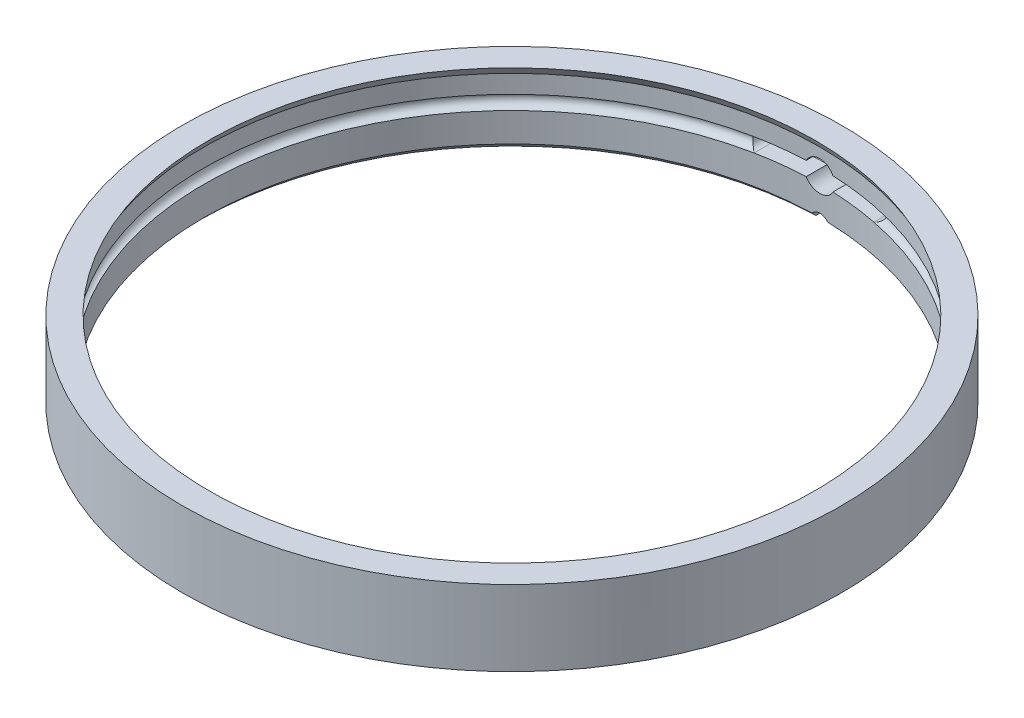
ISO-10303-21;
HEADER;
FILE_DESCRIPTION(('STEP AP214'),'2;1');
FILE_NAME('part.step','',(''),(''),'','','');
FILE_SCHEMA(('AUTOMOTIVE_DESIGN { 1 0 10303 214 1 1 1 1 }'));
ENDSEC;
DATA;
#1=APPLICATION_CONTEXT('core data for automotive mechanical design processes');
#2=APPLICATION_PROTOCOL_DEFINITION('international standard','automotive_design',2000,#1);
#3=PRODUCT_CONTEXT('',#1,'mechanical');
#4=PRODUCT('Part','Part','',(#3));
#5=PRODUCT_RELATED_PRODUCT_CATEGORY('part','',(#4));
#6=PRODUCT_DEFINITION_FORMATION('','',#4);
#7=PRODUCT_DEFINITION_CONTEXT('part definition',#1,'design');
#8=PRODUCT_DEFINITION('design','',#6,#7);
#9=PRODUCT_DEFINITION_SHAPE('','',#8);
#10=(LENGTH_UNIT() NAMED_UNIT(*) SI_UNIT(.MILLI.,.METRE.));
#11=(NAMED_UNIT(*) PLANE_ANGLE_UNIT() SI_UNIT($,.RADIAN.));
#12=(NAMED_UNIT(*) SI_UNIT($,.STERADIAN.) SOLID_ANGLE_UNIT());
#13=UNCERTAINTY_MEASURE_WITH_UNIT(LENGTH_MEASURE(1.E-05),#10,'distance_accuracy_value','');
#14=(GEOMETRIC_REPRESENTATION_CONTEXT(3) GLOBAL_UNCERTAINTY_ASSIGNED_CONTEXT((#13)) GLOBAL_UNIT_ASSIGNED_CONTEXT((#10,
#11,#12)) REPRESENTATION_CONTEXT('',''));
#15=CARTESIAN_POINT('',(0.,0.,0.));
#16=DIRECTION('',(0.,0.,1.));
#17=DIRECTION('',(1.,0.,0.));
#18=AXIS2_PLACEMENT_3D('',#15,#16,#17);
#19=CARTESIAN_POINT('',(0.,19.05,0.));
#20=DIRECTION('',(0.,-1.,0.));
#21=DIRECTION('',(0.,0.,-1.));
#22=AXIS2_PLACEMENT_3D('',#19,#20,#21);
#23=CYLINDRICAL_SURFACE('',#22,83.185);
#24=CARTESIAN_POINT('',(3.36969078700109,12.446,-83.1167215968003));
#25=CARTESIAN_POINT('',(3.31968015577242,12.5408027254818,-83.1187485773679));
#26=CARTESIAN_POINT('',(3.26565454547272,12.633478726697,-83.1208941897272));
#27=CARTESIAN_POINT('',(3.1499972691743,12.813945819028,-83.1253578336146));
#28=CARTESIAN_POINT('',(3.08836598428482,12.9017371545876,-83.1276758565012));
#29=CARTESIAN_POINT('',(2.95796146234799,13.0717540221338,-83.1324180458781));
#30=CARTESIAN_POINT('',(2.8891932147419,13.1539833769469,-83.1348421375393));
#31=CARTESIAN_POINT('',(2.74500289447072,13.3123415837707,-83.1397281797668));
#32=CARTESIAN_POINT('',(2.66958089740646,13.3884705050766,-83.1421901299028));
#33=CARTESIAN_POINT('',(2.43402091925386,13.6069474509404,-83.1495301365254));
#34=CARTESIAN_POINT('',(2.26453287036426,13.7394586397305,-83.1543644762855));
#35=CARTESIAN_POINT('',(1.90582206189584,13.9740439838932,-83.1633586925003));
#36=CARTESIAN_POINT('',(1.71660316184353,14.0761240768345,-83.1675187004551));
#37=CARTESIAN_POINT('',(1.3236903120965,14.2470796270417,-83.1746993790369));
#38=CARTESIAN_POINT('',(1.11999798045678,14.3159587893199,-83.1777201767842));
#39=CARTESIAN_POINT('',(0.703899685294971,14.4185408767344,-83.1822819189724));
#40=CARTESIAN_POINT('',(0.491492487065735,14.4522387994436,-83.1838226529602));
#41=CARTESIAN_POINT('',(0.0642344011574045,14.4834695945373,-83.1852491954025));
#42=CARTESIAN_POINT('',(-0.150613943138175,14.481037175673,-83.185136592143));
#43=CARTESIAN_POINT('',(-0.576830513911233,14.4401605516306,-83.1832730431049));
#44=CARTESIAN_POINT('',(-0.788199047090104,14.4017195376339,-83.181522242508));
#45=CARTESIAN_POINT('',(-1.20139535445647,14.2899527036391,-83.1765806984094));
#46=CARTESIAN_POINT('',(-1.40322672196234,14.2166401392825,-83.1733905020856));
#47=CARTESIAN_POINT('',(-1.79177138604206,14.0371909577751,-83.1659280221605));
#48=CARTESIAN_POINT('',(-1.97848113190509,13.9310466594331,-83.1616554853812));
#49=CARTESIAN_POINT('',(-2.33164911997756,13.6888356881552,-83.1525040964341));
#50=CARTESIAN_POINT('',(-2.49808184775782,13.5527319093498,-83.1476244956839));
#51=CARTESIAN_POINT('',(-2.80561856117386,13.2545716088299,-83.1378158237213));
#52=CARTESIAN_POINT('',(-2.94675090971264,13.0925445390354,-83.1328868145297));
#53=CARTESIAN_POINT('',(-3.12838575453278,12.8447090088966,-83.1261721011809));
#54=CARTESIAN_POINT('',(-3.18078538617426,12.7673887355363,-83.1241800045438));
#55=CARTESIAN_POINT('',(-3.27968022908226,12.6092528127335,-83.1203365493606));
#56=CARTESIAN_POINT('',(-3.32618602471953,12.5284437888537,-83.1184849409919));
#57=CARTESIAN_POINT('',(-3.36969078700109,12.446,-83.1167215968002));
#58=B_SPLINE_CURVE_WITH_KNOTS('',3,(#24,#25,#26,#27,#28,#29,#30,#31,#32,#33,#34,#35,#36,#37,#38,
#39,#40,#41,#42,#43,#44,#45,#46,#47,#48,#49,#50,#51,#52,#53,#54,#55,#56,#57),.UNSPECIFIED.,.F.,
.F.,(4,2,2,2,2,2,2,2,2,2,2,2,2,2,2,2,4),(0.,0.321507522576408,0.642998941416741,
0.964267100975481,1.28553161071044,1.92778791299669,2.56991881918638,3.21197805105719,
3.85412856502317,4.49566223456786,5.13713905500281,5.77837222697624,6.41975553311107,
7.061937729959,7.70339544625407,7.98346076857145,8.26301578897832),.UNSPECIFIED.);
#59=CARTESIAN_POINT('',(3.36969078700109,12.446,-83.1167215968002));
#60=VERTEX_POINT('',#59);
#61=CARTESIAN_POINT('',(-3.36969078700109,12.446,-83.1167215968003));
#62=VERTEX_POINT('',#61);
#63=EDGE_CURVE('E245',#60,#62,#58,.T.);
#64=ORIENTED_EDGE('',*,*,#63,.T.);
#65=CARTESIAN_POINT('',(0.,12.446,0.));
#66=DIRECTION('',(0.,1.,0.));
#67=DIRECTION('',(-1.,0.,0.));
#68=AXIS2_PLACEMENT_3D('',#65,#66,#67);
#69=CIRCLE('',#68,83.185);
#70=CARTESIAN_POINT('',(-15.113,12.446,-81.8006201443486));
#71=VERTEX_POINT('',#70);
#72=EDGE_CURVE('E128',#62,#71,#69,.T.);
#73=ORIENTED_EDGE('',*,*,#72,.T.);
#74=CARTESIAN_POINT('',(-15.113,12.446,-81.8006201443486));
#75=CARTESIAN_POINT('',(-15.163770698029,12.4459992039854,-81.7912403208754));
#76=CARTESIAN_POINT('',(-15.2145080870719,12.4438240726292,-81.7818171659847));
#77=CARTESIAN_POINT('',(-15.3156049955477,12.4351480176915,-81.762944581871));
#78=CARTESIAN_POINT('',(-15.3659645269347,12.4286472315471,-81.7534951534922));
#79=CARTESIAN_POINT('',(-15.5158968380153,12.4027108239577,-81.7252192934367));
#80=CARTESIAN_POINT('',(-15.6144440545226,12.3768410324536,-81.7064429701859));
#81=CARTESIAN_POINT('',(-15.805814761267,12.3086189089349,-81.6696392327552));
#82=CARTESIAN_POINT('',(-15.8986351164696,12.2662576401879,-81.6516122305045));
#83=CARTESIAN_POINT('',(-16.0758570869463,12.1661775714,-81.6169050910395));
#84=CARTESIAN_POINT('',(-16.1602611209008,12.108463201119,-81.6002245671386));
#85=CARTESIAN_POINT('',(-16.3176670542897,11.9796188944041,-81.5688934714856));
#86=CARTESIAN_POINT('',(-16.3907357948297,11.9085735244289,-81.5542310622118));
#87=CARTESIAN_POINT('',(-16.5238707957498,11.7547705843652,-81.527360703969));
#88=CARTESIAN_POINT('',(-16.5839361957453,11.6720122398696,-81.5151529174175));
#89=CARTESIAN_POINT('',(-16.6882116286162,11.4986873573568,-81.4938685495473));
#90=CARTESIAN_POINT('',(-16.7326818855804,11.4082837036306,-81.48474068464));
#91=CARTESIAN_POINT('',(-16.8057861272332,11.2210421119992,-81.4696948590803));
#92=CARTESIAN_POINT('',(-16.8344229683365,11.1242053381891,-81.4637763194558));
#93=CARTESIAN_POINT('',(-16.8745432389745,10.9287924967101,-81.455475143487));
#94=CARTESIAN_POINT('',(-16.8863378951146,10.8302829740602,-81.4530283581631));
#95=CARTESIAN_POINT('',(-16.8933959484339,10.6326491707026,-81.4515648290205));
#96=CARTESIAN_POINT('',(-16.888660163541,10.5335249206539,-81.4525479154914));
#97=CARTESIAN_POINT('',(-16.8629353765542,10.3384568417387,-81.4578774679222));
#98=CARTESIAN_POINT('',(-16.8420995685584,10.2424918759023,-81.4621922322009));
#99=CARTESIAN_POINT('',(-16.7850191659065,10.0554679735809,-81.4739725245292));
#100=CARTESIAN_POINT('',(-16.748774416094,9.9644090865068,-81.4814380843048));
#101=CARTESIAN_POINT('',(-16.6617604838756,9.78922757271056,-81.4992756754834));
#102=CARTESIAN_POINT('',(-16.6109155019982,9.70514417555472,-81.5096628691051));
#103=CARTESIAN_POINT('',(-16.4963053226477,9.54670070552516,-81.5329353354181));
#104=CARTESIAN_POINT('',(-16.4325397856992,9.47234088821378,-81.5458206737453));
#105=CARTESIAN_POINT('',(-16.2927739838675,9.33411976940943,-81.5738615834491));
#106=CARTESIAN_POINT('',(-16.2165889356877,9.27045228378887,-81.5890511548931));
#107=CARTESIAN_POINT('',(-16.0549026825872,9.15675070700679,-81.6210212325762));
#108=CARTESIAN_POINT('',(-15.9693975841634,9.10672234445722,-81.6378024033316));
#109=CARTESIAN_POINT('',(-15.7897309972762,9.02074891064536,-81.6727442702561));
#110=CARTESIAN_POINT('',(-15.6954330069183,8.98509813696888,-81.6909255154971));
#111=CARTESIAN_POINT('',(-15.5023437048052,8.9302606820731,-81.7277870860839));
#112=CARTESIAN_POINT('',(-15.403559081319,8.9110502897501,-81.7464666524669));
#113=CARTESIAN_POINT('',(-15.2722486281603,8.89685670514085,-81.7710444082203));
#114=CARTESIAN_POINT('',(-15.2404280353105,8.89428424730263,-81.7769810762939));
#115=CARTESIAN_POINT('',(-15.1767436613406,8.89085819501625,-81.7888239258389));
#116=CARTESIAN_POINT('',(-15.1448800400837,8.89000174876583,-81.7947301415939));
#117=CARTESIAN_POINT('',(-15.113,8.89,-81.8006201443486));
#118=B_SPLINE_CURVE_WITH_KNOTS('',3,(#74,#75,#76,#77,#78,#79,#80,#81,#82,#83,#84,#85,#86,#87,
#88,#89,#90,#91,#92,#93,#94,#95,#96,#97,#98,#99,#100,#101,#102,#103,#104,#105,#106,#107,#108,
#109,#110,#111,#112,#113,#114,#115,#116,#117),.UNSPECIFIED.,.F.,.F.,(4,2,2,2,2,2,2,2,2,2,2,2,2,
2,2,2,2,2,2,2,2,4),(0.,0.15479448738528,0.309584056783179,0.618799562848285,0.928182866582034,
1.23747700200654,1.54487165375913,1.8522866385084,2.15429614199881,2.4562511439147,
2.75255072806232,3.04883565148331,3.3423355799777,3.63583846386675,3.93089355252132,
4.22595639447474,4.52589565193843,4.82596069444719,5.13188916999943,5.43737567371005,
5.53475869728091,5.63197974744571),.UNSPECIFIED.);
#119=CARTESIAN_POINT('',(-15.113,8.89,-81.8006201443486));
#120=VERTEX_POINT('',#119);
#121=EDGE_CURVE('E127',#71,#120,#118,.T.);
#122=ORIENTED_EDGE('',*,*,#121,.T.);
#123=CARTESIAN_POINT('',(0.,8.89,0.));
#124=DIRECTION('',(0.,1.,0.));
#125=DIRECTION('',(-1.,0.,0.));
#126=AXIS2_PLACEMENT_3D('',#123,#124,#125);
#127=CIRCLE('',#126,83.185);
#128=CARTESIAN_POINT('',(-3.36969078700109,8.89,-83.1167215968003));
#129=VERTEX_POINT('',#128);
#130=EDGE_CURVE('E137',#129,#120,#127,.T.);
#131=ORIENTED_EDGE('',*,*,#130,.F.);
#132=CARTESIAN_POINT('',(-3.36969078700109,8.89,-83.1167215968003));
#133=CARTESIAN_POINT('',(-3.31968015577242,8.79519727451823,-83.1187485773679));
#134=CARTESIAN_POINT('',(-3.26565454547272,8.70252127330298,-83.1208941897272));
#135=CARTESIAN_POINT('',(-3.1499972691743,8.52205418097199,-83.1253578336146));
#136=CARTESIAN_POINT('',(-3.08836598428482,8.43426284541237,-83.1276758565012));
#137=CARTESIAN_POINT('',(-2.95796146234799,8.26424597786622,-83.1324180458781));
#138=CARTESIAN_POINT('',(-2.8891932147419,8.18201662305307,-83.1348421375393));
#139=CARTESIAN_POINT('',(-2.74500289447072,8.02365841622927,-83.1397281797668));
#140=CARTESIAN_POINT('',(-2.66958089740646,7.94752949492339,-83.1421901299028));
#141=CARTESIAN_POINT('',(-2.43402091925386,7.72905254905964,-83.1495301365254));
#142=CARTESIAN_POINT('',(-2.26453287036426,7.5965413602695,-83.1543644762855));
#143=CARTESIAN_POINT('',(-1.90582206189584,7.36195601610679,-83.1633586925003));
#144=CARTESIAN_POINT('',(-1.71660316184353,7.25987592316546,-83.1675187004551));
#145=CARTESIAN_POINT('',(-1.3236903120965,7.08892037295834,-83.1746993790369));
#146=CARTESIAN_POINT('',(-1.11999798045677,7.02004121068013,-83.1777201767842));
#147=CARTESIAN_POINT('',(-0.70389968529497,6.91745912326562,-83.1822819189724));
#148=CARTESIAN_POINT('',(-0.491492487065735,6.88376120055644,-83.1838226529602));
#149=CARTESIAN_POINT('',(-0.0642344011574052,6.85253040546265,-83.1852491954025));
#150=CARTESIAN_POINT('',(0.150613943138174,6.854962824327,-83.185136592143));
#151=CARTESIAN_POINT('',(0.576830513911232,6.89583944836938,-83.1832730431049));
#152=CARTESIAN_POINT('',(0.788199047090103,6.93428046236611,-83.181522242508));
#153=CARTESIAN_POINT('',(1.20139535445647,7.04604729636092,-83.1765806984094));
#154=CARTESIAN_POINT('',(1.40322672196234,7.11935986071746,-83.1733905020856));
#155=CARTESIAN_POINT('',(1.79177138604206,7.29880904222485,-83.1659280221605));
#156=CARTESIAN_POINT('',(1.97848113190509,7.4049533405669,-83.1616554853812));
#157=CARTESIAN_POINT('',(2.33164911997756,7.64716431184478,-83.1525040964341));
#158=CARTESIAN_POINT('',(2.49808184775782,7.78326809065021,-83.1476244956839));
#159=CARTESIAN_POINT('',(2.80561856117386,8.08142839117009,-83.1378158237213));
#160=CARTESIAN_POINT('',(2.94675090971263,8.24345546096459,-83.1328868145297));
#161=CARTESIAN_POINT('',(3.12838575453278,8.49129099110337,-83.1261721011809));
#162=CARTESIAN_POINT('',(3.18078538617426,8.56861126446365,-83.1241800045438));
#163=CARTESIAN_POINT('',(3.27968022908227,8.72674718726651,-83.1203365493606));
#164=CARTESIAN_POINT('',(3.32618602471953,8.80755621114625,-83.1184849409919));
#165=CARTESIAN_POINT('',(3.36969078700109,8.89,-83.1167215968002));
#166=B_SPLINE_CURVE_WITH_KNOTS('',3,(#132,#133,#134,#135,#136,#137,#138,#139,#140,#141,#142,
#143,#144,#145,#146,#147,#148,#149,#150,#151,#152,#153,#154,#155,#156,#157,#158,#159,#160,#161,
#162,#163,#164,#165),.UNSPECIFIED.,.F.,.F.,(4,2,2,2,2,2,2,2,2,2,2,2,2,2,2,2,4),(0.,
0.321507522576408,0.642998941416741,0.964267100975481,1.28553161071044,1.92778791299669,
2.56991881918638,3.21197805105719,3.85412856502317,4.49566223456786,5.13713905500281,
5.77837222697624,6.41975553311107,7.061937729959,7.70339544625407,7.98346076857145,
8.26301578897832),.UNSPECIFIED.);
#167=CARTESIAN_POINT('',(3.36969078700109,8.89,-83.1167215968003));
#168=VERTEX_POINT('',#167);
#169=EDGE_CURVE('E256',#129,#168,#166,.T.);
#170=ORIENTED_EDGE('',*,*,#169,.T.);
#171=CARTESIAN_POINT('',(0.,8.89,0.));
#172=DIRECTION('',(0.,1.,0.));
#173=DIRECTION('',(-1.,0.,0.));
#174=AXIS2_PLACEMENT_3D('',#171,#172,#173);
#175=CIRCLE('',#174,83.185);
#176=CARTESIAN_POINT('',(15.113,8.89,-81.8006201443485));
#177=VERTEX_POINT('',#176);
#178=EDGE_CURVE('E347',#177,#168,#175,.T.);
#179=ORIENTED_EDGE('',*,*,#178,.F.);
#180=CARTESIAN_POINT('',(15.113,8.89,-81.8006201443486));
#181=CARTESIAN_POINT('',(15.163770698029,8.89000079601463,-81.7912403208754));
#182=CARTESIAN_POINT('',(15.2145080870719,8.89217592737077,-81.7818171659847));
#183=CARTESIAN_POINT('',(15.3156049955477,8.90085198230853,-81.762944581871));
#184=CARTESIAN_POINT('',(15.3659645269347,8.90735276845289,-81.7534951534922));
#185=CARTESIAN_POINT('',(15.5158968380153,8.93328917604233,-81.7252192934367));
#186=CARTESIAN_POINT('',(15.6144440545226,8.95915896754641,-81.7064429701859));
#187=CARTESIAN_POINT('',(15.805814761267,9.02738109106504,-81.6696392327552));
#188=CARTESIAN_POINT('',(15.8986351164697,9.06974235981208,-81.6516122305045));
#189=CARTESIAN_POINT('',(16.0758570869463,9.16982242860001,-81.6169050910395));
#190=CARTESIAN_POINT('',(16.1602611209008,9.22753679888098,-81.6002245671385));
#191=CARTESIAN_POINT('',(16.3176670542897,9.35638110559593,-81.5688934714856));
#192=CARTESIAN_POINT('',(16.3907357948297,9.42742647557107,-81.5542310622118));
#193=CARTESIAN_POINT('',(16.5238707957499,9.58122941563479,-81.527360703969));
#194=CARTESIAN_POINT('',(16.5839361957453,9.66398776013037,-81.5151529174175));
#195=CARTESIAN_POINT('',(16.6882116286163,9.83731264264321,-81.4938685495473));
#196=CARTESIAN_POINT('',(16.7326818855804,9.92771629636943,-81.48474068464));
#197=CARTESIAN_POINT('',(16.8057861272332,10.1149578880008,-81.4696948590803));
#198=CARTESIAN_POINT('',(16.8344229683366,10.2117946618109,-81.4637763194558));
#199=CARTESIAN_POINT('',(16.8745432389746,10.4072075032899,-81.455475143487));
#200=CARTESIAN_POINT('',(16.8863378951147,10.5057170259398,-81.4530283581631));
#201=CARTESIAN_POINT('',(16.8933959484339,10.7033508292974,-81.4515648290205));
#202=CARTESIAN_POINT('',(16.8886601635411,10.8024750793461,-81.4525479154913));
#203=CARTESIAN_POINT('',(16.8629353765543,10.9975431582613,-81.4578774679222));
#204=CARTESIAN_POINT('',(16.8420995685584,11.0935081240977,-81.4621922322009));
#205=CARTESIAN_POINT('',(16.7850191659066,11.2805320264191,-81.4739725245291));
#206=CARTESIAN_POINT('',(16.7487744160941,11.3715909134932,-81.4814380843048));
#207=CARTESIAN_POINT('',(16.6617604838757,11.5467724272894,-81.4992756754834));
#208=CARTESIAN_POINT('',(16.6109155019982,11.6308558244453,-81.5096628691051));
#209=CARTESIAN_POINT('',(16.4963053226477,11.7892992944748,-81.5329353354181));
#210=CARTESIAN_POINT('',(16.4325397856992,11.8636591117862,-81.5458206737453));
#211=CARTESIAN_POINT('',(16.2927739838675,12.0018802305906,-81.5738615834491));
#212=CARTESIAN_POINT('',(16.2165889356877,12.0655477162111,-81.5890511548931));
#213=CARTESIAN_POINT('',(16.0549026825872,12.1792492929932,-81.6210212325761));
#214=CARTESIAN_POINT('',(15.9693975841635,12.2292776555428,-81.6378024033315));
#215=CARTESIAN_POINT('',(15.7897309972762,12.3152510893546,-81.6727442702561));
#216=CARTESIAN_POINT('',(15.6954330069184,12.3509018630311,-81.6909255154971));
#217=CARTESIAN_POINT('',(15.5023437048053,12.4057393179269,-81.7277870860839));
#218=CARTESIAN_POINT('',(15.4035590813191,12.4249497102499,-81.7464666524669));
#219=CARTESIAN_POINT('',(15.2722486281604,12.4391432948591,-81.7710444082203));
#220=CARTESIAN_POINT('',(15.2404280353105,12.4417157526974,-81.7769810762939));
#221=CARTESIAN_POINT('',(15.1767436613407,12.4451418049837,-81.7888239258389));
#222=CARTESIAN_POINT('',(15.1448800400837,12.4459982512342,-81.7947301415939));
#223=CARTESIAN_POINT('',(15.113,12.446,-81.8006201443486));
#224=B_SPLINE_CURVE_WITH_KNOTS('',3,(#180,#181,#182,#183,#184,#185,#186,#187,#188,#189,#190,
#191,#192,#193,#194,#195,#196,#197,#198,#199,#200,#201,#202,#203,#204,#205,#206,#207,#208,#209,
#210,#211,#212,#213,#214,#215,#216,#217,#218,#219,#220,#221,#222,#223),.UNSPECIFIED.,.F.,.F.,(4,
2,2,2,2,2,2,2,2,2,2,2,2,2,2,2,2,2,2,2,2,4),(0.,0.154794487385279,0.309584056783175,
0.618799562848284,0.928182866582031,1.23747700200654,1.54487165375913,1.8522866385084,
2.15429614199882,2.4562511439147,2.75255072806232,3.04883565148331,3.34233557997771,
3.63583846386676,3.93089355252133,4.22595639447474,4.52589565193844,4.82596069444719,
5.13188916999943,5.43737567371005,5.53475869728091,5.63197974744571),.UNSPECIFIED.);
#225=CARTESIAN_POINT('',(15.113,12.446,-81.8006201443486));
#226=VERTEX_POINT('',#225);
#227=EDGE_CURVE('E238',#177,#226,#224,.T.);
#228=ORIENTED_EDGE('',*,*,#227,.T.);
#229=CARTESIAN_POINT('',(0.,12.446,0.));
#230=DIRECTION('',(0.,1.,0.));
#231=DIRECTION('',(-1.,0.,0.));
#232=AXIS2_PLACEMENT_3D('',#229,#230,#231);
#233=CIRCLE('',#232,83.185);
#234=EDGE_CURVE('E456',#226,#60,#233,.T.);
#235=ORIENTED_EDGE('',*,*,#234,.T.);
#236=EDGE_LOOP('',(#64,#73,#122,#131,#170,#179,#228,#235));
#237=FACE_BOUND('',#236,.T.);
#238=CARTESIAN_POINT('',(0.,19.05,0.));
#239=DIRECTION('',(0.,1.,0.));
#240=DIRECTION('',(0.,0.,1.));
#241=AXIS2_PLACEMENT_3D('',#238,#239,#240);
#242=CIRCLE('',#241,83.185);
#243=CARTESIAN_POINT('',(0.,19.05,83.185));
#244=VERTEX_POINT('',#243);
#245=EDGE_CURVE('E164',#244,#244,#242,.T.);
#246=ORIENTED_EDGE('',*,*,#245,.F.);
#247=EDGE_LOOP('',(#246));
#248=FACE_BOUND('',#247,.T.);
#249=CARTESIAN_POINT('',(0.,0.,0.));
#250=DIRECTION('',(0.,1.,0.));
#251=DIRECTION('',(0.,0.,1.));
#252=AXIS2_PLACEMENT_3D('',#249,#250,#251);
#253=CIRCLE('',#252,83.185);
#254=CARTESIAN_POINT('',(-2.54,0.,-83.1462123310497));
#255=VERTEX_POINT('',#254);
#256=CARTESIAN_POINT('',(2.54,0.,-83.1462123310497));
#257=VERTEX_POINT('',#256);
#258=EDGE_CURVE('E158',#255,#257,#253,.T.);
#259=ORIENTED_EDGE('',*,*,#258,.T.);
#260=CARTESIAN_POINT('',(2.54,0.,-83.1462123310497));
#261=CARTESIAN_POINT('',(2.5400068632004,0.0714220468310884,-83.1462114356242));
#262=CARTESIAN_POINT('',(2.53698755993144,0.142840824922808,-83.146304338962));
#263=CARTESIAN_POINT('',(2.52494973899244,0.285167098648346,-83.1466711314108));
#264=CARTESIAN_POINT('',(2.51593151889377,0.356074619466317,-83.1469450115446));
#265=CARTESIAN_POINT('',(2.49195762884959,0.496829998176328,-83.1476668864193));
#266=CARTESIAN_POINT('',(2.47700624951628,0.566678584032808,-83.1481147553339));
#267=CARTESIAN_POINT('',(2.44128759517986,0.704850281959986,-83.1491711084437));
#268=CARTESIAN_POINT('',(2.4205203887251,0.773173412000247,-83.1497795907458));
#269=CARTESIAN_POINT('',(2.34966439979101,0.975192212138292,-83.1518224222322));
#270=CARTESIAN_POINT('',(2.29101083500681,1.10599809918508,-83.15347448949));
#271=CARTESIAN_POINT('',(2.1526259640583,1.3558085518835,-83.1571715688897));
#272=CARTESIAN_POINT('',(2.07289864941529,1.47481534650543,-83.159216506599));
#273=CARTESIAN_POINT('',(1.89457075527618,1.69781550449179,-83.1634701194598));
#274=CARTESIAN_POINT('',(1.79596428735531,1.8018041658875,-83.1656788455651));
#275=CARTESIAN_POINT('',(1.58268002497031,1.9917644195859,-83.1700108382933));
#276=CARTESIAN_POINT('',(1.46799978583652,2.07773326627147,-83.1721340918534));
#277=CARTESIAN_POINT('',(1.22581097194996,2.22921270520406,-83.1760558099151));
#278=CARTESIAN_POINT('',(1.09830045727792,2.29472019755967,-83.1778542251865));
#279=CARTESIAN_POINT('',(0.834093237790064,2.4033916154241,-83.1809229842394));
#280=CARTESIAN_POINT('',(0.697397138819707,2.44655701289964,-83.1821933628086));
#281=CARTESIAN_POINT('',(0.418734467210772,2.50931326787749,-83.1840626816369));
#282=CARTESIAN_POINT('',(0.276769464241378,2.52891108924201,-83.1846618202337));
#283=CARTESIAN_POINT('',(-0.00844012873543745,2.54399728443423,-83.1851217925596));
#284=CARTESIAN_POINT('',(-0.151684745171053,2.53948515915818,-83.1849826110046));
#285=CARTESIAN_POINT('',(-0.43533220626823,2.50648462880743,-83.1839817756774));
#286=CARTESIAN_POINT('',(-0.575736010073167,2.47800445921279,-83.1831203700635));
#287=CARTESIAN_POINT('',(-0.849768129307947,2.39788909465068,-83.1807724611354));
#288=CARTESIAN_POINT('',(-0.98339645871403,2.34625394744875,-83.1792859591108));
#289=CARTESIAN_POINT('',(-1.24011415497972,2.22128374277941,-83.1758549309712));
#290=CARTESIAN_POINT('',(-1.36320145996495,2.14794445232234,-83.1739103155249));
#291=CARTESIAN_POINT('',(-1.59531380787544,1.9816544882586,-83.1697823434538));
#292=CARTESIAN_POINT('',(-1.70433949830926,1.88870471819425,-83.1675989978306));
#293=CARTESIAN_POINT('',(-1.90527390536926,1.68580099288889,-83.1632387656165));
#294=CARTESIAN_POINT('',(-1.99717791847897,1.57584238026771,-83.1610618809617));
#295=CARTESIAN_POINT('',(-2.16125155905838,1.34201030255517,-83.1569598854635));
#296=CARTESIAN_POINT('',(-2.23341493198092,1.218132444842,-83.1550348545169));
#297=CARTESIAN_POINT('',(-2.35595471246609,0.959959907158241,-83.1516534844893));
#298=CARTESIAN_POINT('',(-2.40631765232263,0.825658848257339,-83.1501974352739));
#299=CARTESIAN_POINT('',(-2.48370217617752,0.550606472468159,-83.1479222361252));
#300=CARTESIAN_POINT('',(-2.51075937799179,0.40986534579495,-83.1471021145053));
#301=CARTESIAN_POINT('',(-2.53054798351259,0.223487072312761,-83.1465005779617));
#302=CARTESIAN_POINT('',(-2.53409435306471,0.178823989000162,-83.1463925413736));
#303=CARTESIAN_POINT('',(-2.5388171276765,0.0894466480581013,-83.1462485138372));
#304=CARTESIAN_POINT('',(-2.53999744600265,0.0447325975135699,-83.1462124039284));
#305=CARTESIAN_POINT('',(-2.54,0.,-83.1462123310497));
#306=B_SPLINE_CURVE_WITH_KNOTS('',3,(#260,#261,#262,#263,#264,#265,#266,#267,#268,#269,#270,
#271,#272,#273,#274,#275,#276,#277,#278,#279,#280,#281,#282,#283,#284,#285,#286,#287,#288,#289,
#290,#291,#292,#293,#294,#295,#296,#297,#298,#299,#300,#301,#302,#303,#304,#305),.UNSPECIFIED.,
.F.,.F.,(4,2,2,2,2,2,2,2,2,2,2,2,2,2,2,2,2,2,2,2,2,2,4),(0.,0.21419639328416,0.428382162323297,
0.642413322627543,0.856441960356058,1.28431648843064,1.71211003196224,2.14003722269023,
2.56802956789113,2.99608672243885,3.42411567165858,3.85201811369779,4.27992941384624,
4.70769374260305,5.13545718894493,5.56330411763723,5.99113133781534,6.41907591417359,
6.84715592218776,7.27550001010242,7.70318829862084,7.83755583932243,7.97170096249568),.UNSPECIFIED.);
#307=EDGE_CURVE('E196',#257,#255,#306,.T.);
#308=ORIENTED_EDGE('',*,*,#307,.T.);
#309=EDGE_LOOP('',(#259,#308));
#310=FACE_BOUND('',#309,.T.);
#311=ADVANCED_FACE('F33',(#237,#248,#310),#23,.T.);
#312=CARTESIAN_POINT('',(0.,19.05,0.));
#313=DIRECTION('',(0.,1.,0.));
#314=DIRECTION('',(0.,0.,1.));
#315=AXIS2_PLACEMENT_3D('',#312,#313,#314);
#316=PLANE('',#315);
#317=CARTESIAN_POINT('',(0.,19.05,0.));
#318=DIRECTION('',(0.,-1.,0.));
#319=DIRECTION('',(0.,0.,-1.));
#320=AXIS2_PLACEMENT_3D('',#317,#318,#319);
#321=CIRCLE('',#320,76.5554242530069);
#322=CARTESIAN_POINT('',(0.,19.05,-76.5554242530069));
#323=VERTEX_POINT('',#322);
#324=EDGE_CURVE('E353',#323,#323,#321,.T.);
#325=ORIENTED_EDGE('',*,*,#324,.T.);
#326=EDGE_LOOP('',(#325));
#327=FACE_BOUND('',#326,.T.);
#328=ORIENTED_EDGE('',*,*,#245,.T.);
#329=EDGE_LOOP('',(#328));
#330=FACE_BOUND('',#329,.T.);
#331=ADVANCED_FACE('F222',(#327,#330),#316,.T.);
#332=CARTESIAN_POINT('',(0.,0.,0.));
#333=DIRECTION('',(0.,1.,0.));
#334=DIRECTION('',(0.,0.,1.));
#335=AXIS2_PLACEMENT_3D('',#332,#333,#334);
#336=PLANE('',#335);
#337=DIRECTION('',(0.,0.,-1.));
#338=VECTOR('',#337,1.);
#339=CARTESIAN_POINT('',(-2.54,0.,-70.485));
#340=LINE('',#339,#338);
#341=CARTESIAN_POINT('',(-2.54,0.,-79.2754193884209));
#342=VERTEX_POINT('',#341);
#343=EDGE_CURVE('E346',#255,#342,#340,.F.);
#344=ORIENTED_EDGE('',*,*,#343,.T.);
#345=CARTESIAN_POINT('',(0.,0.,0.));
#346=DIRECTION('',(0.,1.,0.));
#347=DIRECTION('',(0.,0.,1.));
#348=AXIS2_PLACEMENT_3D('',#345,#346,#347);
#349=CIRCLE('',#348,79.3161000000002);
#350=CARTESIAN_POINT('',(2.54,0.,-79.2754193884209));
#351=VERTEX_POINT('',#350);
#352=EDGE_CURVE('E11',#342,#351,#349,.T.);
#353=ORIENTED_EDGE('',*,*,#352,.T.);
#354=DIRECTION('',(0.,0.,-1.));
#355=VECTOR('',#354,1.);
#356=CARTESIAN_POINT('',(2.54,0.,-70.485));
#357=LINE('',#356,#355);
#358=EDGE_CURVE('E349',#351,#257,#357,.T.);
#359=ORIENTED_EDGE('',*,*,#358,.T.);
#360=ORIENTED_EDGE('',*,*,#258,.F.);
#361=EDGE_LOOP('',(#344,#353,#359,#360));
#362=FACE_BOUND('',#361,.T.);
#363=ADVANCED_FACE('F227',(#362),#336,.F.);
#364=CARTESIAN_POINT('',(0.,0.,0.));
#365=DIRECTION('',(0.,-1.,0.));
#366=DIRECTION('',(0.,0.,-1.));
#367=AXIS2_PLACEMENT_3D('',#364,#365,#366);
#368=CYLINDRICAL_SURFACE('',#367,77.7286000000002);
#369=CARTESIAN_POINT('',(0.,8.89,0.));
#370=DIRECTION('',(0.,-1.,0.));
#371=DIRECTION('',(0.,0.,-1.));
#372=AXIS2_PLACEMENT_3D('',#369,#370,#371);
#373=CIRCLE('',#372,77.7286000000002);
#374=CARTESIAN_POINT('',(3.36969078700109,8.89,-77.6555242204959));
#375=VERTEX_POINT('',#374);
#376=CARTESIAN_POINT('',(15.113,8.89,-76.2452128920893));
#377=VERTEX_POINT('',#376);
#378=EDGE_CURVE('E155',#375,#377,#373,.T.);
#379=ORIENTED_EDGE('',*,*,#378,.F.);
#380=CARTESIAN_POINT('',(-3.36969078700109,8.89,-77.6555242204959));
#381=CARTESIAN_POINT('',(-3.31967844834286,8.79519405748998,-77.6576938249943));
#382=CARTESIAN_POINT('',(-3.26565103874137,8.70251528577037,-77.6599903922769));
#383=CARTESIAN_POINT('',(-3.14999004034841,8.52204341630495,-77.6647680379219));
#384=CARTESIAN_POINT('',(-3.0883568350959,8.43425007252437,-77.667249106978));
#385=CARTESIAN_POINT('',(-2.95794823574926,8.26422957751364,-77.6723248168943));
#386=CARTESIAN_POINT('',(-2.88917781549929,8.18199861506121,-77.6749193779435));
#387=CARTESIAN_POINT('',(-2.7449829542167,8.02363761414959,-77.6801489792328));
#388=CARTESIAN_POINT('',(-2.66955858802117,7.94750750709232,-77.6827840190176));
#389=CARTESIAN_POINT('',(-2.43399120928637,7.72902757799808,-77.690640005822));
#390=CARTESIAN_POINT('',(-2.26449769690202,7.59651498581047,-77.6958141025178));
#391=CARTESIAN_POINT('',(-1.90577351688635,7.36192764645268,-77.7054403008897));
#392=CARTESIAN_POINT('',(-1.71654671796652,7.25984694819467,-77.7098925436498));
#393=CARTESIAN_POINT('',(-1.32361869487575,7.08889362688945,-77.717577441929));
#394=CARTESIAN_POINT('',(-1.11991937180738,7.02001665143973,-77.7208102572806));
#395=CARTESIAN_POINT('',(-0.703805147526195,6.91744100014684,-77.725691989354));
#396=CARTESIAN_POINT('',(-0.491389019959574,6.88374729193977,-77.727340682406));
#397=CARTESIAN_POINT('',(-0.0641420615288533,6.85252999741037,-77.7288667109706));
#398=CARTESIAN_POINT('',(0.150685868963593,6.85496682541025,-77.7287459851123));
#399=CARTESIAN_POINT('',(0.576860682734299,6.89584523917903,-77.7267515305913));
#400=CARTESIAN_POINT('',(0.788207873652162,6.93428362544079,-77.7248779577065));
#401=CARTESIAN_POINT('',(1.2013518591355,7.04603475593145,-77.7195902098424));
#402=CARTESIAN_POINT('',(1.40315267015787,7.11933268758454,-77.7161766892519));
#403=CARTESIAN_POINT('',(1.79163964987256,7.2987411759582,-77.7081918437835));
#404=CARTESIAN_POINT('',(1.97832225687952,7.40485943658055,-77.7036202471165));
#405=CARTESIAN_POINT('',(2.33146354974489,7.64702197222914,-77.6938275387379));
#406=CARTESIAN_POINT('',(2.49789437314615,7.78310676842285,-77.6886055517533));
#407=CARTESIAN_POINT('',(2.80543222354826,8.08122737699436,-77.6781082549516));
#408=CARTESIAN_POINT('',(2.94656759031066,8.24323375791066,-77.6728330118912));
#409=CARTESIAN_POINT('',(3.1282438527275,8.49108493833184,-77.6656450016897));
#410=CARTESIAN_POINT('',(3.18067602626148,8.56844336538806,-77.6635115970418));
#411=CARTESIAN_POINT('',(3.27963006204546,8.72666003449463,-77.6593955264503));
#412=CARTESIAN_POINT('',(3.32616251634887,8.80751164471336,-77.6574125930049));
#413=CARTESIAN_POINT('',(3.36969078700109,8.89,-77.6555242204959));
#414=B_SPLINE_CURVE_WITH_KNOTS('',3,(#380,#381,#382,#383,#384,#385,#386,#387,#388,#389,#390,
#391,#392,#393,#394,#395,#396,#397,#398,#399,#400,#401,#402,#403,#404,#405,#406,#407,#408,#409,
#410,#411,#412,#413),.UNSPECIFIED.,.F.,.F.,(4,2,2,2,2,2,2,2,2,2,2,2,2,2,2,2,4),(0.,
0.321526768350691,0.643037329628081,0.964325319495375,1.28560969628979,1.92790504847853,
2.57007471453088,3.21216018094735,3.854336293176,4.49580887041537,5.13722444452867,
5.77836771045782,6.41966158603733,7.06182801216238,7.70327042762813,7.98349420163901,
8.26320752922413),.UNSPECIFIED.);
#415=CARTESIAN_POINT('',(-3.36969078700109,8.89,-77.6555242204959));
#416=VERTEX_POINT('',#415);
#417=EDGE_CURVE('E147',#416,#375,#414,.T.);
#418=ORIENTED_EDGE('',*,*,#417,.F.);
#419=CARTESIAN_POINT('',(0.,8.89,0.));
#420=DIRECTION('',(0.,1.,0.));
#421=DIRECTION('',(-1.,0.,0.));
#422=AXIS2_PLACEMENT_3D('',#419,#420,#421);
#423=CIRCLE('',#422,77.7286000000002);
#424=CARTESIAN_POINT('',(-15.113,8.89,-76.2452128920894));
#425=VERTEX_POINT('',#424);
#426=EDGE_CURVE('E134',#416,#425,#423,.T.);
#427=ORIENTED_EDGE('',*,*,#426,.T.);
#428=EDGE_CURVE('E146',#377,#425,#373,.T.);
#429=ORIENTED_EDGE('',*,*,#428,.F.);
#430=EDGE_LOOP('',(#379,#418,#427,#429));
#431=FACE_BOUND('',#430,.T.);
#432=CARTESIAN_POINT('',(-2.54,0.,-77.6870881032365));
#433=CARTESIAN_POINT('',(-2.54000686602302,0.0714194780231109,-77.6870871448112));
#434=CARTESIAN_POINT('',(-2.53698777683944,0.14283568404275,-77.6871865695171));
#435=CARTESIAN_POINT('',(-2.52495082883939,0.285156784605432,-77.6875791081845));
#436=CARTESIAN_POINT('',(-2.51593326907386,0.356061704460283,-77.6878722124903));
#437=CARTESIAN_POINT('',(-2.49196119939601,0.496811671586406,-77.6886447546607));
#438=CARTESIAN_POINT('',(-2.47701099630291,0.566657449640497,-77.6891240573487));
#439=CARTESIAN_POINT('',(-2.441295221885,0.704823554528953,-77.6902545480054));
#440=CARTESIAN_POINT('',(-2.42052971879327,0.773143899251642,-77.6909057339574));
#441=CARTESIAN_POINT('',(-2.34967974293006,0.975154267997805,-77.69309192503));
#442=CARTESIAN_POINT('',(-2.29103136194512,1.10595460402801,-77.694859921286));
#443=CARTESIAN_POINT('',(-2.15265914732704,1.35575509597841,-77.6988164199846));
#444=CARTESIAN_POINT('',(-2.07293928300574,1.47475746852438,-77.7010048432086));
#445=CARTESIAN_POINT('',(-1.8946243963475,1.69775548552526,-77.7055570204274));
#446=CARTESIAN_POINT('',(-1.79602269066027,1.80174579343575,-77.7079208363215));
#447=CARTESIAN_POINT('',(-1.58274767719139,1.99171052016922,-77.7125570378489));
#448=CARTESIAN_POINT('',(-1.46807192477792,2.07768219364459,-77.7148294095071));
#449=CARTESIAN_POINT('',(-1.22588760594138,2.22917072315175,-77.719026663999));
#450=CARTESIAN_POINT('',(-1.09837673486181,2.29468389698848,-77.7209514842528));
#451=CARTESIAN_POINT('',(-0.834166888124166,2.4033662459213,-77.7242359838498));
#452=CARTESIAN_POINT('',(-0.697468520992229,2.44653689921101,-77.7255957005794));
#453=CARTESIAN_POINT('',(-0.418806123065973,2.50930116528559,-77.7275964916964));
#454=CARTESIAN_POINT('',(-0.276843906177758,2.52890282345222,-77.7282378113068));
#455=CARTESIAN_POINT('',(0.0083609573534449,2.54399742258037,-77.7287303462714));
#456=CARTESIAN_POINT('',(0.151603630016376,2.53948987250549,-77.7285815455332));
#457=CARTESIAN_POINT('',(0.435240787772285,2.50649998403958,-77.7275107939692));
#458=CARTESIAN_POINT('',(0.575636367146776,2.47802704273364,-77.7265891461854));
#459=CARTESIAN_POINT('',(0.849653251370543,2.39792922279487,-77.7240769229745));
#460=CARTESIAN_POINT('',(0.983274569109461,2.34630438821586,-77.7224863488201));
#461=CARTESIAN_POINT('',(1.2399834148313,2.22135627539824,-77.7188149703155));
#462=CARTESIAN_POINT('',(1.36306862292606,2.14802823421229,-77.7167340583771));
#463=CARTESIAN_POINT('',(1.59517920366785,1.98176229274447,-77.7123166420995));
#464=CARTESIAN_POINT('',(1.70420521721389,1.88882528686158,-77.7099801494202));
#465=CARTESIAN_POINT('',(1.90514945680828,1.68594167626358,-77.7053137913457));
#466=CARTESIAN_POINT('',(1.99706196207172,1.5759894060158,-77.7029839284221));
#467=CARTESIAN_POINT('',(2.16115368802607,1.3421679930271,-77.6985935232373));
#468=CARTESIAN_POINT('',(2.2333266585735,1.21829445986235,-77.6965330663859));
#469=CARTESIAN_POINT('',(2.35588638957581,0.960127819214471,-77.6929136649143));
#470=CARTESIAN_POINT('',(2.40625965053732,0.825828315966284,-77.6913550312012));
#471=CARTESIAN_POINT('',(2.48366463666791,0.550776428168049,-77.6889193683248));
#472=CARTESIAN_POINT('',(2.51073197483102,0.410034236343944,-77.6880412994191));
#473=CARTESIAN_POINT('',(2.53053617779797,0.223626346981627,-77.6873969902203));
#474=CARTESIAN_POINT('',(2.53408697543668,0.178935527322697,-77.6872812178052));
#475=CARTESIAN_POINT('',(2.53881564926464,0.0895025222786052,-77.6871268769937));
#476=CARTESIAN_POINT('',(2.53999744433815,0.0447605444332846,-77.6870881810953));
#477=CARTESIAN_POINT('',(2.54,0.,-77.6870881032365));
#478=B_SPLINE_CURVE_WITH_KNOTS('',3,(#432,#433,#434,#435,#436,#437,#438,#439,#440,#441,#442,
#443,#444,#445,#446,#447,#448,#449,#450,#451,#452,#453,#454,#455,#456,#457,#458,#459,#460,#461,
#462,#463,#464,#465,#466,#467,#468,#469,#470,#471,#472,#473,#474,#475,#476,#477),.UNSPECIFIED.,
.F.,.F.,(4,2,2,2,2,2,2,2,2,2,2,2,2,2,2,2,2,2,2,2,2,2,4),(0.,0.214188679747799,0.428366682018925,
0.642389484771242,0.856409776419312,1.28426709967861,1.71204388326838,2.13997236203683,
2.56796599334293,2.99603661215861,3.42407890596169,3.85197504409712,4.27987989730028,
4.70761704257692,5.13535337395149,5.56318364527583,5.99099440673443,6.41894792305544,
6.84703678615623,7.27539036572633,7.70308822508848,7.83753971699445,7.97176861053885),.UNSPECIFIED.);
#479=CARTESIAN_POINT('',(-1.98278686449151,1.58749999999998,-77.7033063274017));
#480=VERTEX_POINT('',#479);
#481=CARTESIAN_POINT('',(1.98278686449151,1.58749999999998,-77.7033063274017));
#482=VERTEX_POINT('',#481);
#483=EDGE_CURVE('E167',#480,#482,#478,.T.);
#484=ORIENTED_EDGE('',*,*,#483,.T.);
#485=CARTESIAN_POINT('',(0.,1.58749999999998,0.));
#486=DIRECTION('',(0.,1.,0.));
#487=DIRECTION('',(0.,0.,1.));
#488=AXIS2_PLACEMENT_3D('',#485,#486,#487);
#489=CIRCLE('',#488,77.7286000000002);
#490=EDGE_CURVE('E177',#482,#480,#489,.F.);
#491=ORIENTED_EDGE('',*,*,#490,.T.);
#492=EDGE_LOOP('',(#484,#491));
#493=FACE_BOUND('',#492,.T.);
#494=ADVANCED_FACE('F144',(#431,#493),#368,.F.);
#495=CARTESIAN_POINT('',(0.,10.668,0.));
#496=DIRECTION('',(0.,-1.,0.));
#497=DIRECTION('',(0.,0.,-1.));
#498=AXIS2_PLACEMENT_3D('',#495,#496,#497);
#499=TOROIDAL_SURFACE('',#498,77.7286000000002,1.77800000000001);
#500=ORIENTED_EDGE('',*,*,#428,.T.);
#501=CARTESIAN_POINT('',(-15.113,8.89,-76.2452128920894));
#502=CARTESIAN_POINT('',(-15.1151933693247,8.89000000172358,-76.2470141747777));
#503=CARTESIAN_POINT('',(-15.1173868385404,8.8900040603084,-76.2488154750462));
#504=CARTESIAN_POINT('',(-15.2356933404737,8.89044182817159,-76.3459665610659));
#505=CARTESIAN_POINT('',(-15.3520562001,8.90224244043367,-76.4413411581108));
#506=CARTESIAN_POINT('',(-15.5823801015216,8.94904033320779,-76.6297750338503));
#507=CARTESIAN_POINT('',(-15.6963348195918,8.98409234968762,-76.7228283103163));
#508=CARTESIAN_POINT('',(-15.9041404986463,9.07224426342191,-76.8922245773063));
#509=CARTESIAN_POINT('',(-15.9987001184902,9.12246694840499,-76.9691837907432));
#510=CARTESIAN_POINT('',(-16.1803751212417,9.24189491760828,-77.1168372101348));
#511=CARTESIAN_POINT('',(-16.2675031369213,9.31106711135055,-77.1875420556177));
#512=CARTESIAN_POINT('',(-16.413024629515,9.4517979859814,-77.3054903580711));
#513=CARTESIAN_POINT('',(-16.4735671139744,9.51964084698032,-77.3545085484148));
#514=CARTESIAN_POINT('',(-16.5853867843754,9.66705501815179,-77.4449694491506));
#515=CARTESIAN_POINT('',(-16.6366741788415,9.74661322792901,-77.486420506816));
#516=CARTESIAN_POINT('',(-16.7197106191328,9.90235405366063,-77.5534894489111));
#517=CARTESIAN_POINT('',(-16.7532883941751,9.9769170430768,-77.5805922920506));
#518=CARTESIAN_POINT('',(-16.8103609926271,10.1322037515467,-77.6266421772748));
#519=CARTESIAN_POINT('',(-16.8338610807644,10.2129242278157,-77.6455934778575));
#520=CARTESIAN_POINT('',(-16.8694041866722,10.378923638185,-77.6742512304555));
#521=CARTESIAN_POINT('',(-16.8813876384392,10.4642238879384,-77.6839096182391));
#522=CARTESIAN_POINT('',(-16.8928005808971,10.6361994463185,-77.6931082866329));
#523=CARTESIAN_POINT('',(-16.8922340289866,10.7228743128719,-77.6926517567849));
#524=CARTESIAN_POINT('',(-16.8792164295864,10.8869375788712,-77.6821595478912));
#525=CARTESIAN_POINT('',(-16.8678214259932,10.964469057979,-77.6729750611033));
#526=CARTESIAN_POINT('',(-16.8353577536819,11.1160851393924,-77.6468002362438));
#527=CARTESIAN_POINT('',(-16.8142886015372,11.1901695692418,-77.6298095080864));
#528=CARTESIAN_POINT('',(-16.7627929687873,11.3355338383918,-77.5882625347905));
#529=CARTESIAN_POINT('',(-16.7320933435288,11.4066524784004,-77.5634854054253));
#530=CARTESIAN_POINT('',(-16.6630140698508,11.5423863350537,-77.5076989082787));
#531=CARTESIAN_POINT('',(-16.6246304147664,11.6069981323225,-77.4766862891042));
#532=CARTESIAN_POINT('',(-16.5247491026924,11.753816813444,-77.3959284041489));
#533=CARTESIAN_POINT('',(-16.4601820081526,11.8325698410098,-77.343679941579));
#534=CARTESIAN_POINT('',(-16.3219762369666,11.9755125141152,-77.2317110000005));
#535=CARTESIAN_POINT('',(-16.2483190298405,12.0396716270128,-77.171975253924));
#536=CARTESIAN_POINT('',(-16.0742447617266,12.1686443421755,-77.0306207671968));
#537=CARTESIAN_POINT('',(-15.9719140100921,12.229111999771,-76.9474020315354));
#538=CARTESIAN_POINT('',(-15.7612234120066,12.3277066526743,-76.7757621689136));
#539=CARTESIAN_POINT('',(-15.6528635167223,12.3658334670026,-76.6873409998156));
#540=CARTESIAN_POINT('',(-15.4732017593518,12.4106191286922,-76.5404747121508));
#541=CARTESIAN_POINT('',(-15.4027568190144,12.4236796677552,-76.482824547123));
#542=CARTESIAN_POINT('',(-15.2613776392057,12.441225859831,-76.3669911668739));
#543=CARTESIAN_POINT('',(-15.1904443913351,12.4457255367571,-76.3088089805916));
#544=CARTESIAN_POINT('',(-15.1173868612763,12.4459959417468,-76.2488154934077));
#545=CARTESIAN_POINT('',(-15.1151933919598,12.4460000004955,-76.2470141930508));
#546=CARTESIAN_POINT('',(-15.113,12.446,-76.2452128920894));
#547=B_SPLINE_CURVE_WITH_KNOTS('',3,(#501,#502,#503,#504,#505,#506,#507,#508,#509,#510,#511,
#512,#513,#514,#515,#516,#517,#518,#519,#520,#521,#522,#523,#524,#525,#526,#527,#528,#529,#530,
#531,#532,#533,#534,#535,#536,#537,#538,#539,#540,#541,#542,#543,#544,#545,#546),.UNSPECIFIED.,
.F.,.F.,(4,2,2,2,2,2,2,2,2,2,2,2,2,2,2,2,2,2,2,2,2,2,4),(0.,0.00851491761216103,
0.459240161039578,0.911030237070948,1.30511175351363,1.69850944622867,2.00726249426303,
2.31567287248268,2.57305251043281,2.83029752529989,3.08886600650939,3.34735295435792,
3.58296750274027,3.81859382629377,4.06162168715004,4.30477660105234,4.64628256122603,
4.98849656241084,5.42153887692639,5.85458469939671,6.13011794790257,6.40519944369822,
6.41371436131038),.UNSPECIFIED.);
#548=CARTESIAN_POINT('',(-15.113,12.446,-76.2452128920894));
#549=VERTEX_POINT('',#548);
#550=EDGE_CURVE('E116',#425,#549,#547,.T.);
#551=ORIENTED_EDGE('',*,*,#550,.T.);
#552=CARTESIAN_POINT('',(0.,12.446,0.));
#553=DIRECTION('',(0.,-1.,0.));
#554=DIRECTION('',(0.,0.,-1.));
#555=AXIS2_PLACEMENT_3D('',#552,#553,#554);
#556=CIRCLE('',#555,77.7286000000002);
#557=CARTESIAN_POINT('',(15.113,12.446,-76.2452128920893));
#558=VERTEX_POINT('',#557);
#559=EDGE_CURVE('E160',#558,#549,#556,.T.);
#560=ORIENTED_EDGE('',*,*,#559,.F.);
#561=CARTESIAN_POINT('',(15.113,12.446,-76.2452128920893));
#562=CARTESIAN_POINT('',(15.1151933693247,12.4459999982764,-76.2470141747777));
#563=CARTESIAN_POINT('',(15.1173868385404,12.4459959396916,-76.2488154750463));
#564=CARTESIAN_POINT('',(15.2356933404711,12.4455581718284,-76.3459665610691));
#565=CARTESIAN_POINT('',(15.3520562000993,12.4337575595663,-76.4413411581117));
#566=CARTESIAN_POINT('',(15.5823801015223,12.3869596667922,-76.6297750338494));
#567=CARTESIAN_POINT('',(15.696334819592,12.3519076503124,-76.7228283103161));
#568=CARTESIAN_POINT('',(15.9041404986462,12.2637557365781,-76.8922245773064));
#569=CARTESIAN_POINT('',(15.9987001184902,12.213533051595,-76.9691837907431));
#570=CARTESIAN_POINT('',(16.1803751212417,12.0941050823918,-77.1168372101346));
#571=CARTESIAN_POINT('',(16.2675031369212,12.0249328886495,-77.1875420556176));
#572=CARTESIAN_POINT('',(16.4130246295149,11.8842020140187,-77.305490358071));
#573=CARTESIAN_POINT('',(16.4735671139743,11.8163591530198,-77.3545085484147));
#574=CARTESIAN_POINT('',(16.5853867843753,11.6689449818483,-77.4449694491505));
#575=CARTESIAN_POINT('',(16.6366741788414,11.5893867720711,-77.4864205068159));
#576=CARTESIAN_POINT('',(16.7197106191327,11.4336459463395,-77.5534894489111));
#577=CARTESIAN_POINT('',(16.753288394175,11.3590829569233,-77.5805922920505));
#578=CARTESIAN_POINT('',(16.8103609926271,11.2037962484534,-77.6266421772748));
#579=CARTESIAN_POINT('',(16.8338610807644,11.1230757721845,-77.6455934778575));
#580=CARTESIAN_POINT('',(16.8694041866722,10.9570763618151,-77.6742512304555));
#581=CARTESIAN_POINT('',(16.8813876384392,10.8717761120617,-77.6839096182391));
#582=CARTESIAN_POINT('',(16.8928005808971,10.6998005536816,-77.6931082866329));
#583=CARTESIAN_POINT('',(16.8922340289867,10.6131256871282,-77.6926517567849));
#584=CARTESIAN_POINT('',(16.8792164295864,10.4490624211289,-77.6821595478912));
#585=CARTESIAN_POINT('',(16.8678214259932,10.3715309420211,-77.6729750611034));
#586=CARTESIAN_POINT('',(16.835357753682,10.2199148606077,-77.6468002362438));
#587=CARTESIAN_POINT('',(16.8142886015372,10.1458304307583,-77.6298095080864));
#588=CARTESIAN_POINT('',(16.7627929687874,10.0004661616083,-77.5882625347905));
#589=CARTESIAN_POINT('',(16.7320933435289,9.92934752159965,-77.5634854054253));
#590=CARTESIAN_POINT('',(16.6630140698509,9.79361366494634,-77.5076989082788));
#591=CARTESIAN_POINT('',(16.6246304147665,9.72900186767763,-77.4766862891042));
#592=CARTESIAN_POINT('',(16.5247491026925,9.58218318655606,-77.3959284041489));
#593=CARTESIAN_POINT('',(16.4601820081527,9.50343015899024,-77.3436799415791));
#594=CARTESIAN_POINT('',(16.3219762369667,9.36048748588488,-77.2317110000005));
#595=CARTESIAN_POINT('',(16.2483190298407,9.29632837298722,-77.171975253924));
#596=CARTESIAN_POINT('',(16.0742447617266,9.16735565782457,-77.030620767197));
#597=CARTESIAN_POINT('',(15.9719140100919,9.10688800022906,-76.9474020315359));
#598=CARTESIAN_POINT('',(15.7612234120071,9.00829334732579,-76.7757621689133));
#599=CARTESIAN_POINT('',(15.6528635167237,8.97016653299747,-76.6873409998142));
#600=CARTESIAN_POINT('',(15.4732017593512,8.92538087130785,-76.5404747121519));
#601=CARTESIAN_POINT('',(15.4027568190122,8.91232033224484,-76.482824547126));
#602=CARTESIAN_POINT('',(15.2613776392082,8.89477414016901,-76.3669911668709));
#603=CARTESIAN_POINT('',(15.1904443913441,8.89027446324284,-76.3088089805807));
#604=CARTESIAN_POINT('',(15.1173868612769,8.89000405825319,-76.2488154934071));
#605=CARTESIAN_POINT('',(15.1151933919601,8.88999999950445,-76.2470141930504));
#606=CARTESIAN_POINT('',(15.113,8.89,-76.2452128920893));
#607=B_SPLINE_CURVE_WITH_KNOTS('',3,(#561,#562,#563,#564,#565,#566,#567,#568,#569,#570,#571,
#572,#573,#574,#575,#576,#577,#578,#579,#580,#581,#582,#583,#584,#585,#586,#587,#588,#589,#590,
#591,#592,#593,#594,#595,#596,#597,#598,#599,#600,#601,#602,#603,#604,#605,#606),.UNSPECIFIED.,
.F.,.F.,(4,2,2,2,2,2,2,2,2,2,2,2,2,2,2,2,2,2,2,2,2,2,4),(0.,0.00851491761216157,
0.459240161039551,0.911030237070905,1.30511175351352,1.69850944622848,2.00726249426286,
2.31567287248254,2.57305251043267,2.83029752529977,3.08886600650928,3.34735295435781,
3.58296750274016,3.81859382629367,4.06162168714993,4.30477660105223,4.6462825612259,
4.9884965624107,5.42153887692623,5.85458469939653,6.13011794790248,6.40519944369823,
6.41371436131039),.UNSPECIFIED.);
#608=EDGE_CURVE('E154',#558,#377,#607,.T.);
#609=ORIENTED_EDGE('',*,*,#608,.T.);
#610=EDGE_LOOP('',(#500,#551,#560,#609));
#611=FACE_BOUND('',#610,.T.);
#612=ADVANCED_FACE('F152',(#611),#499,.F.);
#613=CARTESIAN_POINT('',(0.,0.,0.));
#614=DIRECTION('',(0.,-1.,0.));
#615=DIRECTION('',(0.,0.,-1.));
#616=AXIS2_PLACEMENT_3D('',#613,#614,#615);
#617=CYLINDRICAL_SURFACE('',#616,77.7286000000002);
#618=CARTESIAN_POINT('',(0.,17.018,0.));
#619=DIRECTION('',(0.,-1.,0.));
#620=DIRECTION('',(0.,0.,-1.));
#621=AXIS2_PLACEMENT_3D('',#618,#619,#620);
#622=CIRCLE('',#621,77.7286000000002);
#623=CARTESIAN_POINT('',(0.,17.018,-77.7286000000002));
#624=VERTEX_POINT('',#623);
#625=EDGE_CURVE('E303',#624,#624,#622,.T.);
#626=ORIENTED_EDGE('',*,*,#625,.F.);
#627=EDGE_LOOP('',(#626));
#628=FACE_BOUND('',#627,.T.);
#629=CARTESIAN_POINT('',(0.,12.446,0.));
#630=DIRECTION('',(0.,1.,0.));
#631=DIRECTION('',(-1.,0.,0.));
#632=AXIS2_PLACEMENT_3D('',#629,#630,#631);
#633=CIRCLE('',#632,77.7286000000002);
#634=CARTESIAN_POINT('',(-3.36969078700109,12.446,-77.6555242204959));
#635=VERTEX_POINT('',#634);
#636=EDGE_CURVE('E148',#635,#549,#633,.T.);
#637=ORIENTED_EDGE('',*,*,#636,.F.);
#638=CARTESIAN_POINT('',(3.36969078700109,12.446,-77.6555242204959));
#639=CARTESIAN_POINT('',(3.31967844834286,12.54080594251,-77.6576938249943));
#640=CARTESIAN_POINT('',(3.26565103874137,12.6334847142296,-77.6599903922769));
#641=CARTESIAN_POINT('',(3.14999004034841,12.813956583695,-77.6647680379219));
#642=CARTESIAN_POINT('',(3.0883568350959,12.9017499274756,-77.667249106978));
#643=CARTESIAN_POINT('',(2.95794823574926,13.0717704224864,-77.6723248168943));
#644=CARTESIAN_POINT('',(2.88917781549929,13.1540013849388,-77.6749193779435));
#645=CARTESIAN_POINT('',(2.7449829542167,13.3123623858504,-77.6801489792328));
#646=CARTESIAN_POINT('',(2.66955858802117,13.3884924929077,-77.6827840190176));
#647=CARTESIAN_POINT('',(2.43399120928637,13.6069724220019,-77.690640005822));
#648=CARTESIAN_POINT('',(2.26449769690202,13.7394850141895,-77.6958141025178));
#649=CARTESIAN_POINT('',(1.90577351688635,13.9740723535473,-77.7054403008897));
#650=CARTESIAN_POINT('',(1.71654671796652,14.0761530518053,-77.7098925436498));
#651=CARTESIAN_POINT('',(1.32361869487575,14.2471063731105,-77.717577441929));
#652=CARTESIAN_POINT('',(1.11991937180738,14.3159833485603,-77.7208102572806));
#653=CARTESIAN_POINT('',(0.703805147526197,14.4185589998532,-77.725691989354));
#654=CARTESIAN_POINT('',(0.491389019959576,14.4522527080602,-77.727340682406));
#655=CARTESIAN_POINT('',(0.0641420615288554,14.4834700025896,-77.7288667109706));
#656=CARTESIAN_POINT('',(-0.150685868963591,14.4810331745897,-77.7287459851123));
#657=CARTESIAN_POINT('',(-0.576860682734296,14.440154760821,-77.7267515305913));
#658=CARTESIAN_POINT('',(-0.78820787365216,14.4017163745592,-77.7248779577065));
#659=CARTESIAN_POINT('',(-1.2013518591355,14.2899652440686,-77.7195902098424));
#660=CARTESIAN_POINT('',(-1.40315267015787,14.2166673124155,-77.7161766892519));
#661=CARTESIAN_POINT('',(-1.79163964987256,14.0372588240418,-77.7081918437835));
#662=CARTESIAN_POINT('',(-1.97832225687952,13.9311405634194,-77.7036202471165));
#663=CARTESIAN_POINT('',(-2.33146354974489,13.6889780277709,-77.6938275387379));
#664=CARTESIAN_POINT('',(-2.49789437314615,13.5528932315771,-77.6886055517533));
#665=CARTESIAN_POINT('',(-2.80543222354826,13.2547726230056,-77.6781082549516));
#666=CARTESIAN_POINT('',(-2.94656759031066,13.0927662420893,-77.6728330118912));
#667=CARTESIAN_POINT('',(-3.1282438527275,12.8449150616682,-77.6656450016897));
#668=CARTESIAN_POINT('',(-3.18067602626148,12.7675566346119,-77.6635115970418));
#669=CARTESIAN_POINT('',(-3.27963006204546,12.6093399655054,-77.6593955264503));
#670=CARTESIAN_POINT('',(-3.32616251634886,12.5284883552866,-77.6574125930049));
#671=CARTESIAN_POINT('',(-3.36969078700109,12.446,-77.6555242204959));
#672=B_SPLINE_CURVE_WITH_KNOTS('',3,(#638,#639,#640,#641,#642,#643,#644,#645,#646,#647,#648,
#649,#650,#651,#652,#653,#654,#655,#656,#657,#658,#659,#660,#661,#662,#663,#664,#665,#666,#667,
#668,#669,#670,#671),.UNSPECIFIED.,.F.,.F.,(4,2,2,2,2,2,2,2,2,2,2,2,2,2,2,2,4),(0.,
0.321526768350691,0.643037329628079,0.964325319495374,1.28560969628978,1.92790504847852,
2.57007471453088,3.21216018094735,3.854336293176,4.49580887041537,5.13722444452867,
5.77836771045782,6.41966158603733,7.06182801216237,7.70327042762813,7.98349420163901,
8.26320752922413),.UNSPECIFIED.);
#673=CARTESIAN_POINT('',(3.36969078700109,12.446,-77.6555242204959));
#674=VERTEX_POINT('',#673);
#675=EDGE_CURVE('E306',#674,#635,#672,.T.);
#676=ORIENTED_EDGE('',*,*,#675,.F.);
#677=EDGE_CURVE('E156',#674,#558,#556,.T.);
#678=ORIENTED_EDGE('',*,*,#677,.T.);
#679=ORIENTED_EDGE('',*,*,#559,.T.);
#680=EDGE_LOOP('',(#637,#676,#678,#679));
#681=FACE_BOUND('',#680,.T.);
#682=ADVANCED_FACE('F292',(#628,#681),#617,.F.);
#683=CARTESIAN_POINT('',(0.,17.018,0.));
#684=DIRECTION('',(0.,-1.,0.));
#685=DIRECTION('',(0.,0.,-1.));
#686=AXIS2_PLACEMENT_3D('',#683,#684,#685);
#687=CONICAL_SURFACE('',#686,77.7286000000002,0.523598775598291);
#688=ORIENTED_EDGE('',*,*,#324,.F.);
#689=EDGE_LOOP('',(#688));
#690=FACE_BOUND('',#689,.T.);
#691=ORIENTED_EDGE('',*,*,#625,.T.);
#692=EDGE_LOOP('',(#691));
#693=FACE_BOUND('',#692,.T.);
#694=ADVANCED_FACE('F187',(#690,#693),#687,.F.);
#695=CARTESIAN_POINT('',(0.,0.,-70.485));
#696=DIRECTION('',(0.,0.,-1.));
#697=DIRECTION('',(-1.,0.,0.));
#698=AXIS2_PLACEMENT_3D('',#695,#696,#697);
#699=CYLINDRICAL_SURFACE('',#698,2.54);
#700=ORIENTED_EDGE('',*,*,#483,.F.);
#701=CARTESIAN_POINT('',(-1.98278686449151,1.58749999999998,-77.7033063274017));
#702=CARTESIAN_POINT('',(-2.03674114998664,1.5200789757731,-77.769370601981));
#703=CARTESIAN_POINT('',(-2.08642250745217,1.45101533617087,-77.837138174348));
#704=CARTESIAN_POINT('',(-2.17753268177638,1.31034050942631,-77.9753733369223));
#705=CARTESIAN_POINT('',(-2.21896926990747,1.23873179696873,-78.0458383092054));
#706=CARTESIAN_POINT('',(-2.2933295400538,1.09484093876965,-78.1876409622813));
#707=CARTESIAN_POINT('',(-2.32638917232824,1.02259235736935,-78.2589419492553));
#708=CARTESIAN_POINT('',(-2.38519727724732,0.876710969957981,-78.4031206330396));
#709=CARTESIAN_POINT('',(-2.41094449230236,0.803077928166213,-78.4759985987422));
#710=CARTESIAN_POINT('',(-2.46883472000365,0.609848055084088,-78.6675283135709));
#711=CARTESIAN_POINT('',(-2.49538338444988,0.489463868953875,-78.7871300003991));
#712=CARTESIAN_POINT('',(-2.5220987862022,0.30733740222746,-78.9684976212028));
#713=CARTESIAN_POINT('',(-2.52881911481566,0.245923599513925,-79.0297278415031));
#714=CARTESIAN_POINT('',(-2.53776709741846,0.12299936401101,-79.1524284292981));
#715=CARTESIAN_POINT('',(-2.53999443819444,0.0614889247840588,-79.2138988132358));
#716=CARTESIAN_POINT('',(-2.54,0.,-79.2754193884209));
#717=B_SPLINE_CURVE_WITH_KNOTS('',3,(#701,#702,#703,#704,#705,#706,#707,#708,#709,#710,#711,
#712,#713,#714,#715,#716),.UNSPECIFIED.,.F.,.F.,(4,2,2,2,2,2,2,4),(0.,0.325968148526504,
0.651627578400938,0.971603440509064,1.29163429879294,1.80579590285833,2.06664990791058,
2.32752209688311),.UNSPECIFIED.);
#718=EDGE_CURVE('E42',#480,#342,#717,.T.);
#719=ORIENTED_EDGE('',*,*,#718,.T.);
#720=ORIENTED_EDGE('',*,*,#343,.F.);
#721=ORIENTED_EDGE('',*,*,#307,.F.);
#722=ORIENTED_EDGE('',*,*,#358,.F.);
#723=CARTESIAN_POINT('',(2.54,0.,-79.2754193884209));
#724=CARTESIAN_POINT('',(2.53997293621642,0.0980207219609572,-79.1773464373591));
#725=CARTESIAN_POINT('',(2.53432370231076,0.196155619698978,-79.0793446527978));
#726=CARTESIAN_POINT('',(2.51150189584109,0.392099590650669,-78.8840312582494));
#727=CARTESIAN_POINT('',(2.49430969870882,0.489907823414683,-78.7867211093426));
#728=CARTESIAN_POINT('',(2.44867519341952,0.68197380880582,-78.5959931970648));
#729=CARTESIAN_POINT('',(2.42051262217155,0.776260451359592,-78.5025380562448));
#730=CARTESIAN_POINT('',(2.35254939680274,0.962784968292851,-78.3179957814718));
#731=CARTESIAN_POINT('',(2.31276010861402,1.05502474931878,-78.2269064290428));
#732=CARTESIAN_POINT('',(2.22856690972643,1.22160160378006,-78.0627023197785));
#733=CARTESIAN_POINT('',(2.18600361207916,1.29638426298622,-77.9890988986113));
#734=CARTESIAN_POINT('',(2.09152484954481,1.44389865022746,-77.8441214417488));
#735=CARTESIAN_POINT('',(2.03951910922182,1.51660196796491,-77.7727775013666));
#736=CARTESIAN_POINT('',(1.98278686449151,1.58749999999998,-77.7033063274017));
#737=B_SPLINE_CURVE_WITH_KNOTS('',3,(#723,#724,#725,#726,#727,#728,#729,#730,#731,#732,#733,
#734,#735,#736),.UNSPECIFIED.,.F.,.F.,(4,2,2,2,2,2,4),(0.,0.41591216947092,0.832533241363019,
1.23916121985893,1.64539301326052,1.98468962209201,2.32741953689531),.UNSPECIFIED.);
#738=EDGE_CURVE('E202',#351,#482,#737,.T.);
#739=ORIENTED_EDGE('',*,*,#738,.T.);
#740=EDGE_LOOP('',(#700,#719,#720,#721,#722,#739));
#741=FACE_BOUND('',#740,.T.);
#742=ADVANCED_FACE('F182',(#741),#699,.F.);
#743=CARTESIAN_POINT('',(0.,8.89,83.186));
#744=DIRECTION('',(0.,1.,0.));
#745=DIRECTION('',(-1.,0.,0.));
#746=AXIS2_PLACEMENT_3D('',#743,#744,#745);
#747=PLANE('',#746);
#748=ORIENTED_EDGE('',*,*,#130,.T.);
#749=DIRECTION('',(0.,0.,-1.));
#750=VECTOR('',#749,1.);
#751=CARTESIAN_POINT('',(-15.113,8.89,83.186));
#752=LINE('',#751,#750);
#753=EDGE_CURVE('E119',#425,#120,#752,.T.);
#754=ORIENTED_EDGE('',*,*,#753,.F.);
#755=ORIENTED_EDGE('',*,*,#426,.F.);
#756=DIRECTION('',(0.,0.,-1.));
#757=VECTOR('',#756,1.);
#758=CARTESIAN_POINT('',(-3.36969078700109,8.89,83.186));
#759=LINE('',#758,#757);
#760=EDGE_CURVE('E138',#416,#129,#759,.T.);
#761=ORIENTED_EDGE('',*,*,#760,.T.);
#762=EDGE_LOOP('',(#748,#754,#755,#761));
#763=FACE_BOUND('',#762,.T.);
#764=ADVANCED_FACE('F132',(#763),#747,.T.);
#765=CARTESIAN_POINT('',(0.,8.89,83.186));
#766=DIRECTION('',(0.,1.,0.));
#767=DIRECTION('',(-1.,0.,0.));
#768=AXIS2_PLACEMENT_3D('',#765,#766,#767);
#769=PLANE('',#768);
#770=ORIENTED_EDGE('',*,*,#178,.T.);
#771=DIRECTION('',(0.,0.,-1.));
#772=VECTOR('',#771,1.);
#773=CARTESIAN_POINT('',(3.36969078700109,8.89,83.186));
#774=LINE('',#773,#772);
#775=EDGE_CURVE('E149',#375,#168,#774,.T.);
#776=ORIENTED_EDGE('',*,*,#775,.F.);
#777=ORIENTED_EDGE('',*,*,#378,.T.);
#778=DIRECTION('',(0.,0.,-1.));
#779=VECTOR('',#778,1.);
#780=CARTESIAN_POINT('',(15.113,8.89,83.186));
#781=LINE('',#780,#779);
#782=EDGE_CURVE('E338',#377,#177,#781,.T.);
#783=ORIENTED_EDGE('',*,*,#782,.T.);
#784=EDGE_LOOP('',(#770,#776,#777,#783));
#785=FACE_BOUND('',#784,.T.);
#786=ADVANCED_FACE('F270',(#785),#769,.T.);
#787=CARTESIAN_POINT('',(0.,10.668,83.186));
#788=DIRECTION('',(0.,0.,-1.));
#789=DIRECTION('',(-1.,0.,0.));
#790=AXIS2_PLACEMENT_3D('',#787,#788,#789);
#791=CYLINDRICAL_SURFACE('',#790,3.81);
#792=ORIENTED_EDGE('',*,*,#760,.F.);
#793=ORIENTED_EDGE('',*,*,#417,.T.);
#794=ORIENTED_EDGE('',*,*,#775,.T.);
#795=ORIENTED_EDGE('',*,*,#169,.F.);
#796=EDGE_LOOP('',(#792,#793,#794,#795));
#797=FACE_BOUND('',#796,.T.);
#798=ADVANCED_FACE('F188',(#797),#791,.F.);
#799=CARTESIAN_POINT('',(-15.113,10.668,83.186));
#800=DIRECTION('',(0.,0.,-1.));
#801=DIRECTION('',(-1.,0.,0.));
#802=AXIS2_PLACEMENT_3D('',#799,#800,#801);
#803=CYLINDRICAL_SURFACE('',#802,1.778);
#804=DIRECTION('',(0.,0.,-1.));
#805=VECTOR('',#804,1.);
#806=CARTESIAN_POINT('',(-15.113,12.446,83.186));
#807=LINE('',#806,#805);
#808=EDGE_CURVE('E122',#549,#71,#807,.T.);
#809=ORIENTED_EDGE('',*,*,#808,.F.);
#810=ORIENTED_EDGE('',*,*,#550,.F.);
#811=ORIENTED_EDGE('',*,*,#753,.T.);
#812=ORIENTED_EDGE('',*,*,#121,.F.);
#813=EDGE_LOOP('',(#809,#810,#811,#812));
#814=FACE_BOUND('',#813,.T.);
#815=ADVANCED_FACE('F118',(#814),#803,.F.);
#816=CARTESIAN_POINT('',(0.,12.446,83.186));
#817=DIRECTION('',(0.,1.,0.));
#818=DIRECTION('',(-1.,0.,0.));
#819=AXIS2_PLACEMENT_3D('',#816,#817,#818);
#820=PLANE('',#819);
#821=DIRECTION('',(0.,0.,-1.));
#822=VECTOR('',#821,1.);
#823=CARTESIAN_POINT('',(-3.36969078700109,12.446,83.186));
#824=LINE('',#823,#822);
#825=EDGE_CURVE('E335',#635,#62,#824,.T.);
#826=ORIENTED_EDGE('',*,*,#825,.F.);
#827=ORIENTED_EDGE('',*,*,#636,.T.);
#828=ORIENTED_EDGE('',*,*,#808,.T.);
#829=ORIENTED_EDGE('',*,*,#72,.F.);
#830=EDGE_LOOP('',(#826,#827,#828,#829));
#831=FACE_BOUND('',#830,.T.);
#832=ADVANCED_FACE('F267',(#831),#820,.F.);
#833=CARTESIAN_POINT('',(0.,10.668,83.186));
#834=DIRECTION('',(0.,0.,-1.));
#835=DIRECTION('',(-1.,0.,0.));
#836=AXIS2_PLACEMENT_3D('',#833,#834,#835);
#837=CYLINDRICAL_SURFACE('',#836,3.81);
#838=DIRECTION('',(0.,0.,-1.));
#839=VECTOR('',#838,1.);
#840=CARTESIAN_POINT('',(3.36969078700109,12.446,83.186));
#841=LINE('',#840,#839);
#842=EDGE_CURVE('E331',#674,#60,#841,.T.);
#843=ORIENTED_EDGE('',*,*,#842,.F.);
#844=ORIENTED_EDGE('',*,*,#675,.T.);
#845=ORIENTED_EDGE('',*,*,#825,.T.);
#846=ORIENTED_EDGE('',*,*,#63,.F.);
#847=EDGE_LOOP('',(#843,#844,#845,#846));
#848=FACE_BOUND('',#847,.T.);
#849=ADVANCED_FACE('F319',(#848),#837,.F.);
#850=CARTESIAN_POINT('',(0.,12.446,83.186));
#851=DIRECTION('',(0.,1.,0.));
#852=DIRECTION('',(-1.,0.,0.));
#853=AXIS2_PLACEMENT_3D('',#850,#851,#852);
#854=PLANE('',#853);
#855=DIRECTION('',(0.,0.,-1.));
#856=VECTOR('',#855,1.);
#857=CARTESIAN_POINT('',(15.113,12.446,83.186));
#858=LINE('',#857,#856);
#859=EDGE_CURVE('E334',#558,#226,#858,.T.);
#860=ORIENTED_EDGE('',*,*,#859,.F.);
#861=ORIENTED_EDGE('',*,*,#677,.F.);
#862=ORIENTED_EDGE('',*,*,#842,.T.);
#863=ORIENTED_EDGE('',*,*,#234,.F.);
#864=EDGE_LOOP('',(#860,#861,#862,#863));
#865=FACE_BOUND('',#864,.T.);
#866=ADVANCED_FACE('F218',(#865),#854,.F.);
#867=CARTESIAN_POINT('',(15.113,10.668,83.186));
#868=DIRECTION('',(0.,0.,-1.));
#869=DIRECTION('',(-1.,0.,0.));
#870=AXIS2_PLACEMENT_3D('',#867,#868,#869);
#871=CYLINDRICAL_SURFACE('',#870,1.778);
#872=ORIENTED_EDGE('',*,*,#782,.F.);
#873=ORIENTED_EDGE('',*,*,#608,.F.);
#874=ORIENTED_EDGE('',*,*,#859,.T.);
#875=ORIENTED_EDGE('',*,*,#227,.F.);
#876=EDGE_LOOP('',(#872,#873,#874,#875));
#877=FACE_BOUND('',#876,.T.);
#878=ADVANCED_FACE('F214',(#877),#871,.F.);
#879=CARTESIAN_POINT('',(0.,1.58749999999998,0.));
#880=DIRECTION('',(0.,-1.,0.));
#881=DIRECTION('',(0.,0.,-1.));
#882=AXIS2_PLACEMENT_3D('',#879,#880,#881);
#883=CONICAL_SURFACE('',#882,77.7286000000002,0.785398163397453);
#884=ORIENTED_EDGE('',*,*,#738,.F.);
#885=ORIENTED_EDGE('',*,*,#352,.F.);
#886=ORIENTED_EDGE('',*,*,#718,.F.);
#887=ORIENTED_EDGE('',*,*,#490,.F.);
#888=EDGE_LOOP('',(#884,#885,#886,#887));
#889=FACE_BOUND('',#888,.T.);
#890=ADVANCED_FACE('F35',(#889),#883,.F.);
#891=CLOSED_SHELL('',(#311,#331,#363,#494,#612,#682,#694,#742,#764,#786,#798,#815,#832,#849,
#866,#878,#890));
#892=MANIFOLD_SOLID_BREP('B2',#891);
#893=ADVANCED_BREP_SHAPE_REPRESENTATION('',(#18,#892),#14);
#894=SHAPE_DEFINITION_REPRESENTATION(#9,#893);
ENDSEC;
END-ISO-10303-21;
